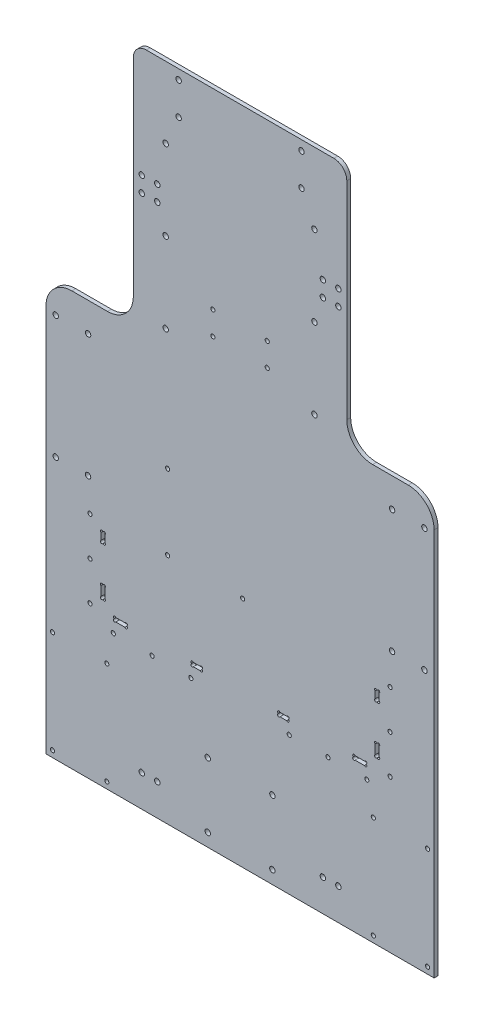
from build123d import *

# Parameters (mm, degrees)
SKETCH_1_W              = 165
SKETCH_1_H              = 510
EXTRUDE_1_DEPTH         = 3
HOLE_WIZARD_4_2_4_2_1_D = 4.2
HOLE_WIZARD_4_2_4_2_2_D = 4.2
SKETCH_6_W              = 67.5
SKETCH_6_H              = 320
EXTRUDE_2_DEPTH         = 3
HOLE_WIZARD_4_2_4_2_3_D = 4.2
HOLE_WIZARD_4_2_4_2_4_D = 4.2
HOLE_WIZARD_4_2_4_2_5_D = 4.2
HOLE_WIZARD_3_2_3_2_1_D = 3.2
HOLE_WIZARD_3_2_3_2_2_D = 3.2
SKETCH_19_W             = 3
SKETCH_19_H             = 8
SKETCH_19_H_2           = 10
SKETCH_19_W_2           = 10
SKETCH_19_H_3           = 3
SKETCH_19_W_3           = 8
CUT_EXTRUDE_1_DEPTH     = 10
SKETCH_20_R             = 1.6
CUT_EXTRUDE_2_DEPTH     = 296.861454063
SKETCH_21_R             = 1.6
CUT_EXTRUDE_3_DEPTH     = 296.861454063
FILLET_1_R              = 20
SKETCH_22_R             = 1
CUT_EXTRUDE_4_DEPTH     = 296.861454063
SKETCH_24_R             = 1
CUT_EXTRUDE_5_DEPTH     = 10
SKETCH_25_R             = 1
CUT_EXTRUDE_6_DEPTH     = 10
SKETCH_26_R             = 1
CUT_EXTRUDE_7_DEPTH     = 10
FILLET_2_R              = 10


with BuildPart() as part:
    # Sketch 1 → Extrude 1 (new body)
    with BuildSketch(Plane.XY):
        Rectangle(SKETCH_1_W, SKETCH_1_H)
    extrude(amount=EXTRUDE_1_DEPTH)

    # Hole Wizard 4.2 _4.2_ _1 (through all)
    with Locations(Plane.XY.offset(3)):
        with Locations((-25, -245), (25, -245), (25, -195), (-25, -195)):
            Hole(HOLE_WIZARD_4_2_4_2_1_D / 2)

    # Hole Wizard 4.2 _4.2_ _2 (through all)
    with Locations(Plane.XY.offset(3)):
        with Locations((47.5, 247.5), (-47.5, 247.5), (-47.5, 222.5), (47.5, 222.5)):
            Hole(HOLE_WIZARD_4_2_4_2_2_D / 2)

    # Sketch 6 → Extrude 2 (add)
    with BuildSketch(Plane.XY.offset(3)):
        with Locations((-116.25, -95)):
            Rectangle(SKETCH_6_W, SKETCH_6_H)
        with Locations((116.25, -95)):
            Rectangle(SKETCH_6_W, SKETCH_6_H)
    extrude(amount=-EXTRUDE_2_DEPTH)

    # Hole Wizard 4.2 _4.2_ _3 (through all)
    with Locations(Plane.XY.offset(3)):
        with Locations((142.5, 42.5), (-142.5, 42.5), (-142.5, -52.5), (-117.5, 42.5), (-117.5, -52.5), (117.5, -52.5), (117.5, 42.5), (142.5, -52.5)):
            Hole(HOLE_WIZARD_4_2_4_2_3_D / 2)

    # Hole Wizard 4.2 _4.2_ _4 (through all)
    with Locations(Plane.XY.offset(3)):
        with Locations((64, 157.5), (76, -230.5), (64, -230.5), (-64, -230.5), (-76, -230.5), (76, 169.5), (64, 169.5), (-64, 169.5), (-76, 169.5), (76, 157.5), (-76, 157.5), (-64, 157.5)):
            Hole(HOLE_WIZARD_4_2_4_2_4_D / 2)

    # Hole Wizard 4.2 _4.2_ _5 (through all)
    with Locations(Plane.XY.offset(3)):
        with Locations((-57.5, 200), (57.5, 200), (57.5, 138), (57.5, 76), (-57.5, 76), (-57.5, 138)):
            Hole(HOLE_WIZARD_4_2_4_2_5_D / 2)

    # Hole Wizard 3.2 _3.2_ _1 (through all)
    with Locations(Plane.XY.offset(3)):
        with Locations((2, -75), (-56, -75), (-56, -17)):
            Hole(HOLE_WIZARD_3_2_3_2_1_D / 2)

    # Hole Wizard 3.2 _3.2_ _2 (through all)
    with Locations(Plane.XY.offset(3)):
        with Locations((21, 89), (21, 107), (-21, 89), (-21, 107)):
            Hole(HOLE_WIZARD_3_2_3_2_2_D / 2)

    # Sketch 19 → Cut-Extrude 1 (cut)
    with BuildSketch(Plane(origin=(0, 0, 0), x_dir=(-1, 0, 0), z_dir=(0, 0, -1))):
        with Locations((106, -88.200000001)):
            Rectangle(SKETCH_19_W, SKETCH_19_H)
        with Locations((106, -124.700000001)):
            Rectangle(SKETCH_19_W, SKETCH_19_H_2)
        with Locations((92.5, -138.200000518)):
            Rectangle(SKETCH_19_W_2, SKETCH_19_H_3)
        with Locations((33.5, -138.200000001)):
            Rectangle(SKETCH_19_W_3, SKETCH_19_H_3)
        with Locations((-106, -88.200000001)):
            Rectangle(SKETCH_19_W, SKETCH_19_H)
        with Locations((-92.5, -138.200000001)):
            Rectangle(SKETCH_19_W_2, SKETCH_19_H_3)
        with Locations((-106, -124.700000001)):
            Rectangle(SKETCH_19_W, SKETCH_19_H_2)
        with Locations((-33.5, -138.200000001)):
            Rectangle(SKETCH_19_W_3, SKETCH_19_H_3)
    extrude(amount=-CUT_EXTRUDE_1_DEPTH, mode=Mode.SUBTRACT)

    # Sketch 20 → Cut-Extrude 2 (cut, through all)
    with BuildSketch(Plane.XY.offset(3)):
        with Locations((116, -77.200000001)):
            Circle(SKETCH_20_R)
        with Locations((116, -107.200000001)):
            Circle(SKETCH_20_R)
        with Locations((116, -137.200000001)):
            Circle(SKETCH_20_R)
        with Locations((98, -148.200000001)):
            Circle(SKETCH_20_R)
        with Locations((68, -148.200000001)):
            Circle(SKETCH_20_R)
        with Locations((38, -148.200000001)):
            Circle(SKETCH_20_R)
    cut_extrude_2 = extrude(amount=-CUT_EXTRUDE_2_DEPTH, mode=Mode.SUBTRACT)

    # Mirror 1: Cut-Extrude 2 across plane
    add(cut_extrude_2.mirror(Plane(origin=(0, 0, 0), x_dir=(0, 0, 1), z_dir=(1, 0, 0))), mode=Mode.SUBTRACT)

    # Sketch 21 → Cut-Extrude 3 (cut, through all)
    with BuildSketch(Plane.XY.offset(3)):
        with Locations((103, -171)):
            Circle(SKETCH_21_R)
        with Locations((145, -171)):
            Circle(SKETCH_21_R)
        with Locations((103, -250)):
            Circle(SKETCH_21_R)
        with Locations((145, -250)):
            Circle(SKETCH_21_R)
    cut_extrude_3 = extrude(amount=-CUT_EXTRUDE_3_DEPTH, mode=Mode.SUBTRACT)

    # Mirror 2: Cut-Extrude 3 across plane
    add(cut_extrude_3.mirror(Plane(origin=(0, 0, 0), x_dir=(0, 0, 1), z_dir=(1, 0, 0))), mode=Mode.SUBTRACT)

    # Fillet 1
    fillet_1_edges = [part.edges().sort_by_distance(p)[0] for p in [
        (-82.5, 65, 1.5),
        (-150, 65, 1.5),
        (82.5, 65, 1.5),
        (150, 65, 1.5),
    ]]
    fillet(fillet_1_edges, radius=FILLET_1_R)

    # Sketch 22 → Cut-Extrude 4 (cut, through all)
    with BuildSketch(Plane.XY.offset(3)):
        with Locations((97, -139.200000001)):
            Circle(SKETCH_22_R)
        with Locations((88.087704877, -139.200000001)):
            Circle(SKETCH_22_R)
        with Locations((88.087704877, -137.200000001)):
            Circle(SKETCH_22_R)
        with Locations((97, -137.200000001)):
            Circle(SKETCH_22_R)
    cut_extrude_4 = extrude(amount=-CUT_EXTRUDE_4_DEPTH, mode=Mode.SUBTRACT)

    # Sketch 24 → Cut-Extrude 5 (cut)
    with BuildSketch(Plane.XY.offset(3)):
        with Locations((105, -120.200000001)):
            Circle(SKETCH_24_R)
        with Locations((107, -120.200000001)):
            Circle(SKETCH_24_R)
        with Locations((107, -129.200000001)):
            Circle(SKETCH_24_R)
        with Locations((105, -129.200000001)):
            Circle(SKETCH_24_R)
    cut_extrude_5 = extrude(amount=-CUT_EXTRUDE_5_DEPTH, mode=Mode.SUBTRACT)

    # Sketch 25 → Cut-Extrude 6 (cut)
    with BuildSketch(Plane.XY.offset(3)):
        with Locations((105, -84.700000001)):
            Circle(SKETCH_25_R)
        with Locations((107, -84.700000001)):
            Circle(SKETCH_25_R)
        with Locations((107, -91.700000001)):
            Circle(SKETCH_25_R)
        with Locations((105, -91.700000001)):
            Circle(SKETCH_25_R)
    cut_extrude_6 = extrude(amount=-CUT_EXTRUDE_6_DEPTH, mode=Mode.SUBTRACT)

    # Sketch 26 → Cut-Extrude 7 (cut)
    with BuildSketch(Plane.XY.offset(3)):
        with Locations((30, -137.200000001)):
            Circle(SKETCH_26_R)
        with Locations((37, -137.200000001)):
            Circle(SKETCH_26_R)
        with Locations((37, -139.200000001)):
            Circle(SKETCH_26_R)
        with Locations((30, -139.200000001)):
            Circle(SKETCH_26_R)
    cut_extrude_7 = extrude(amount=-CUT_EXTRUDE_7_DEPTH, mode=Mode.SUBTRACT)

    # Mirror 3: Cut-Extrude 4, Cut-Extrude 5, Cut-Extrude 6, Cut-Extrude 7 across plane
    add(cut_extrude_4.mirror(Plane(origin=(0, 0, 0), x_dir=(0, 0, 1), z_dir=(1, 0, 0))), mode=Mode.SUBTRACT)
    add(cut_extrude_5.mirror(Plane(origin=(0, 0, 0), x_dir=(0, 0, 1), z_dir=(1, 0, 0))), mode=Mode.SUBTRACT)
    add(cut_extrude_6.mirror(Plane(origin=(0, 0, 0), x_dir=(0, 0, 1), z_dir=(1, 0, 0))), mode=Mode.SUBTRACT)
    add(cut_extrude_7.mirror(Plane(origin=(0, 0, 0), x_dir=(0, 0, 1), z_dir=(1, 0, 0))), mode=Mode.SUBTRACT)

    # Fillet 2
    fillet_2_edges = [part.edges().sort_by_distance(p)[0] for p in [
        (-82.5, 255, 1.5),
        (82.5, 255, 1.5),
    ]]
    fillet(fillet_2_edges, radius=FILLET_2_R)


solid = part.part
